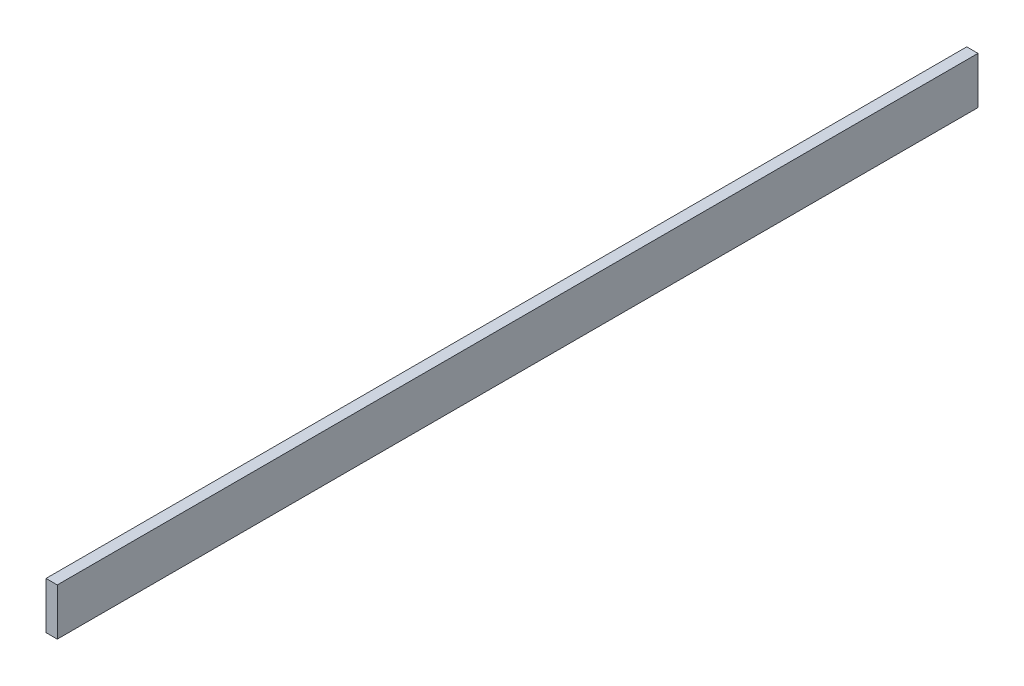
from build123d import *

# Parameters (mm, degrees)
ESQUISSE1_W      = 6
ESQUISSE1_H      = 25
EXTRUSION1_DEPTH = 490


with BuildPart() as part:
    # Esquisse1 → Extrusion1 (new body)
    with BuildSketch(Plane.XY):
        with Locations((3, 12.5)):
            Rectangle(ESQUISSE1_W, ESQUISSE1_H)
    extrude(amount=EXTRUSION1_DEPTH)


solid = part.part
